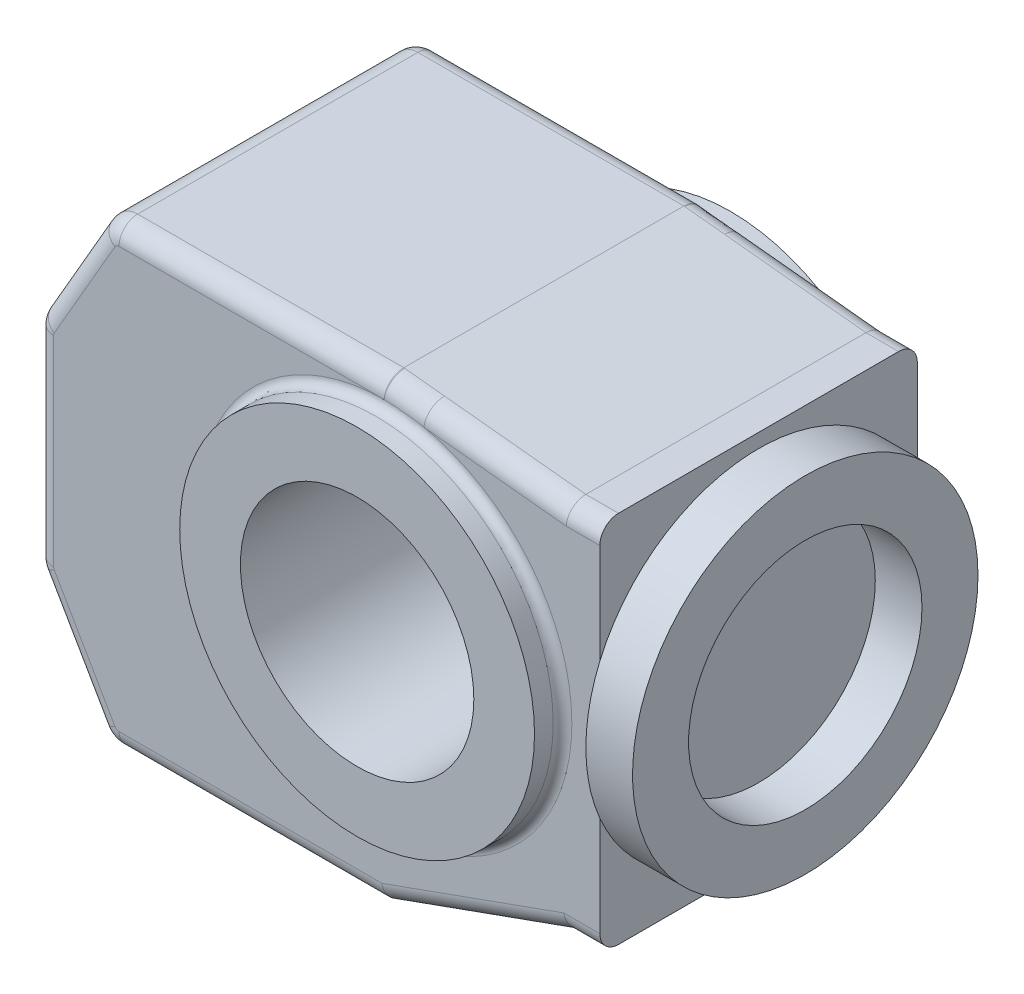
from build123d import *

# Parameters (mm, degrees)
SKETCH2_R           = 38
BASE_EXTRUDE_DEPTH  = 40
BOSS_EXTRUDE1_DEPTH = 34
FILLET1_R           = 2
FILLET2_R           = 4
SKETCH4_R           = 37
EXTRUDE1_DEPTH      = 10
SKETCH5_R           = 25
CUT_EXTRUDE1_DEPTH  = 123.233383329
SKETCH6_R           = 25
CUT_EXTRUDE2_DEPTH  = 10


with BuildPart() as part:
    # Sketch2 → Base-Extrude (new, symmetric)
    with BuildSketch(Plane.XY):
        Circle(SKETCH2_R)
    extrude(amount=BASE_EXTRUDE_DEPTH, both=True)

    # Sketch3 → Boss-Extrude1 (add, symmetric)
    with BuildSketch(Plane.XY):
        with BuildLine():
            Line((46, 40), (46, -40))
            Line((46, -40), (39, -40))
            Line((39, -40), (0, -54))
            Line((0, -54), (-57, -54))
            ThreePointArc((-57, -54), (-59.500000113, -53.330126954), (-61.33012715, -51.499999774))
            Line((-61.33012715, -51.499999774), (-74.33012715, -28.983336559))
            ThreePointArc((-74.33012715, -28.983336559), (-74.829629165, -27.777431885), (-75, -26.483336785))
            Line((-75, -26.483336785), (-75, 16.483342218))
            ThreePointArc((-75, 16.483342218), (-74.829629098, 17.77743757), (-74.330126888, 18.983342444))
            Line((-74.330126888, 18.983342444), (-61.330126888, 41.500000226))
            ThreePointArc((-61.330126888, 41.500000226), (-59.499999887, 43.330127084), (-57, 44))
            Line((-57, 44), (0, 44))
            Line((0, 44), (39, 40))
            Line((39, 40), (46, 40))
        make_face()
    extrude(amount=BOSS_EXTRUDE1_DEPTH, both=True)

    # Fillet1
    fillet1_edges = [part.edges().sort_by_distance(p)[0] for p in [
        (-38, 0, 34),
        (-38, 0, -34),
    ]]
    fillet(fillet1_edges, radius=FILLET1_R)

    # Fillet2
    fillet2_edges = [part.edges().sort_by_distance(p)[0] for p in [
        (42.5, 40, -34),
        (42.5, -40, -34),
        (19.5, 42, -34),
        (19.5, -47, -34),
        (-28.5, 44, -34),
        (-28.5, -54, -34),
        (-59.499999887, 43.330127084, -34),
        (-59.500000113, -53.330126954, -34),
        (-67.830126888, 30.241671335, -34),
        (-67.83012715, -40.241668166, -34),
        (-74.829629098, 17.77743757, -34),
        (-74.829629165, -27.777431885, -34),
        (-75, -4.999997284, -34),
        (42.5, 40, 34),
        (42.5, -40, 34),
        (19.5, 42, 34),
        (19.5, -47, 34),
        (-28.5, 44, 34),
        (-28.5, -54, 34),
        (-59.499999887, 43.330127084, 34),
        (-59.500000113, -53.330126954, 34),
        (-67.830126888, 30.241671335, 34),
        (-67.83012715, -40.241668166, 34),
        (-74.829629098, 17.77743757, 34),
        (-74.829629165, -27.777431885, 34),
        (-75, -4.999997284, 34),
    ]]
    fillet(fillet2_edges, radius=FILLET2_R)

    # Sketch4 → Extrude1 (add)
    with BuildSketch(Plane(origin=(46, 0, 0), x_dir=(0, 0, -1), z_dir=(1, 0, 0))):
        with Locations(Location((0, 0, 0), (0, 0, 156.768543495))):
            Circle(SKETCH4_R)
    extrude(amount=EXTRUDE1_DEPTH)

    # Sketch5 → Cut-Extrude1 (cut, through all)
    with BuildSketch(Plane.XY.offset(40)):
        Circle(SKETCH5_R)
    extrude(amount=-CUT_EXTRUDE1_DEPTH, mode=Mode.SUBTRACT)

    # Sketch6 → Cut-Extrude2 (cut)
    with BuildSketch(Plane(origin=(56, -7.711833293, -13.256783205), x_dir=(0, 0, -1), z_dir=(1, 0, 0))):
        with Locations((-13.256783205, 7.711833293)):
            Circle(SKETCH6_R)
    extrude(amount=-CUT_EXTRUDE2_DEPTH, mode=Mode.SUBTRACT)


solid = part.part
